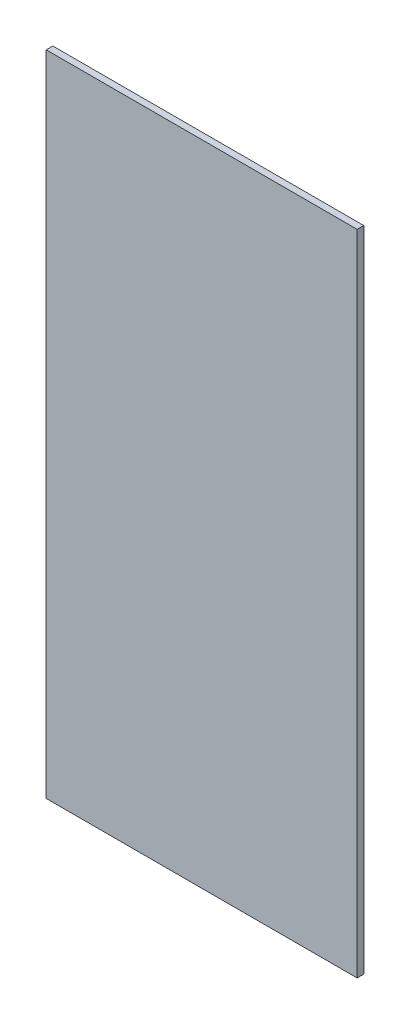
from build123d import *

# Parameters (mm, degrees)
SKETCH_1_W      = 47
SKETCH_1_H      = 98
EXTRUDE_1_DEPTH = 1


with BuildPart() as part:
    # Sketch 1 → Extrude 1 (new body)
    with BuildSketch(Plane.XY):
        with Locations((1.856890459, -8.830388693)):
            Rectangle(SKETCH_1_W, SKETCH_1_H)
    extrude(amount=EXTRUDE_1_DEPTH)


solid = part.part
